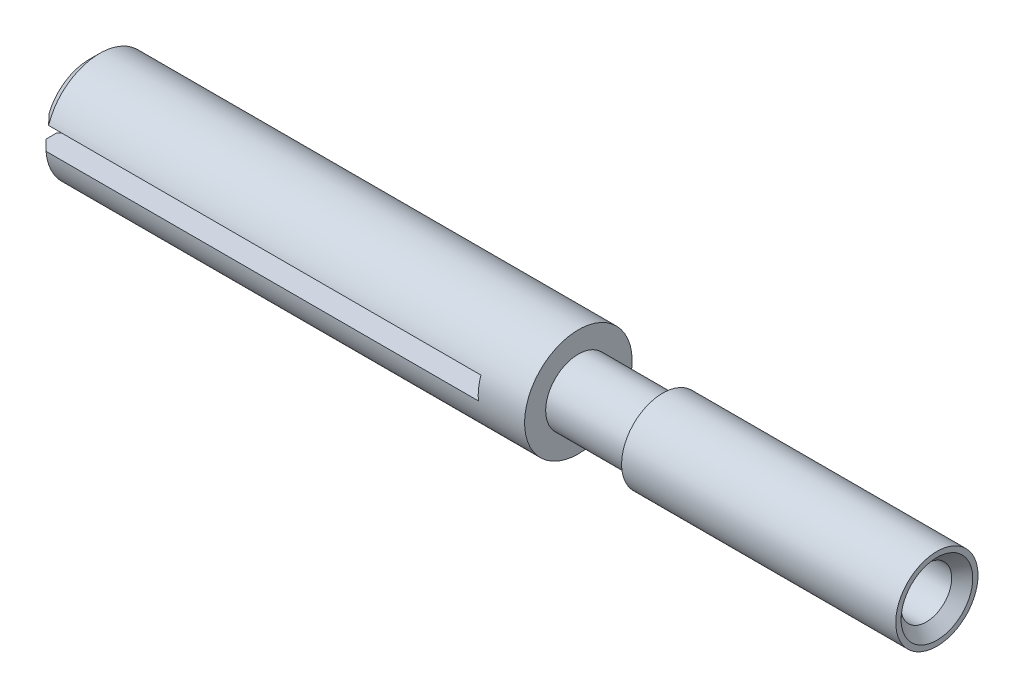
ISO-10303-21;
HEADER;
FILE_DESCRIPTION(('STEP AP214'),'2;1');
FILE_NAME('part.step','',(''),(''),'','','');
FILE_SCHEMA(('AUTOMOTIVE_DESIGN { 1 0 10303 214 1 1 1 1 }'));
ENDSEC;
DATA;
#1=APPLICATION_CONTEXT('core data for automotive mechanical design processes');
#2=APPLICATION_PROTOCOL_DEFINITION('international standard','automotive_design',2000,#1);
#3=PRODUCT_CONTEXT('',#1,'mechanical');
#4=PRODUCT('Part','Part','',(#3));
#5=PRODUCT_RELATED_PRODUCT_CATEGORY('part','',(#4));
#6=PRODUCT_DEFINITION_FORMATION('','',#4);
#7=PRODUCT_DEFINITION_CONTEXT('part definition',#1,'design');
#8=PRODUCT_DEFINITION('design','',#6,#7);
#9=PRODUCT_DEFINITION_SHAPE('','',#8);
#10=(LENGTH_UNIT() NAMED_UNIT(*) SI_UNIT(.MILLI.,.METRE.));
#11=(NAMED_UNIT(*) PLANE_ANGLE_UNIT() SI_UNIT($,.RADIAN.));
#12=(NAMED_UNIT(*) SI_UNIT($,.STERADIAN.) SOLID_ANGLE_UNIT());
#13=UNCERTAINTY_MEASURE_WITH_UNIT(LENGTH_MEASURE(1.E-05),#10,'distance_accuracy_value','');
#14=(GEOMETRIC_REPRESENTATION_CONTEXT(3) GLOBAL_UNCERTAINTY_ASSIGNED_CONTEXT((#13)) GLOBAL_UNIT_ASSIGNED_CONTEXT((#10,
#11,#12)) REPRESENTATION_CONTEXT('',''));
#15=CARTESIAN_POINT('',(0.,0.,0.));
#16=DIRECTION('',(0.,0.,1.));
#17=DIRECTION('',(1.,0.,0.));
#18=AXIS2_PLACEMENT_3D('',#15,#16,#17);
#19=CARTESIAN_POINT('',(-28.7,-0.300000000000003,0.));
#20=DIRECTION('',(-1.,0.,0.));
#21=DIRECTION('',(0.,-1.,0.));
#22=AXIS2_PLACEMENT_3D('',#19,#20,#21);
#23=CONICAL_SURFACE('',#22,1.55,0.785398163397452);
#24=CARTESIAN_POINT('',(-28.7,-0.300000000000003,0.));
#25=DIRECTION('',(-1.,0.,0.));
#26=DIRECTION('',(0.,-1.,0.));
#27=AXIS2_PLACEMENT_3D('',#24,#25,#26);
#28=CIRCLE('',#27,1.55);
#29=CARTESIAN_POINT('',(-28.7,0.499999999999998,1.32759180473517));
#30=VERTEX_POINT('',#29);
#31=CARTESIAN_POINT('',(-28.7,0.499999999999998,-1.32759180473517));
#32=VERTEX_POINT('',#31);
#33=EDGE_CURVE('E232',#30,#32,#28,.T.);
#34=ORIENTED_EDGE('',*,*,#33,.T.);
#35=CARTESIAN_POINT('',(-29.7599731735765,0.499999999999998,-2.48434296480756));
#36=CARTESIAN_POINT('',(-29.7108259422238,0.499999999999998,-2.43270831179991));
#37=CARTESIAN_POINT('',(-29.6617519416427,0.499999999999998,-2.38100379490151));
#38=CARTESIAN_POINT('',(-29.5637859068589,0.499999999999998,-2.27742116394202));
#39=CARTESIAN_POINT('',(-29.5148938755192,0.499999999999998,-2.22554304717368));
#40=CARTESIAN_POINT('',(-29.3684921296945,0.499999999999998,-2.0695421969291));
#41=CARTESIAN_POINT('',(-29.2713114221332,0.499999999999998,-1.965110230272));
#42=CARTESIAN_POINT('',(-29.0783894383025,0.499999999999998,-1.75511516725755));
#43=CARTESIAN_POINT('',(-28.9826467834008,0.499999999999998,-1.64955334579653));
#44=CARTESIAN_POINT('',(-28.8407493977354,0.499999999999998,-1.48970567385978));
#45=CARTESIAN_POINT('',(-28.7937414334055,0.499999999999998,-1.43617825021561));
#46=CARTESIAN_POINT('',(-28.7005012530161,0.499999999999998,-1.3284530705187));
#47=CARTESIAN_POINT('',(-28.6542690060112,0.499999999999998,-1.2742553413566));
#48=CARTESIAN_POINT('',(-28.5749164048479,0.499999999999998,-1.17935241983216));
#49=CARTESIAN_POINT('',(-28.5415498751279,0.499999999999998,-1.13885340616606));
#50=CARTESIAN_POINT('',(-28.4755789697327,0.499999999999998,-1.05723155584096));
#51=CARTESIAN_POINT('',(-28.4429746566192,0.499999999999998,-1.0161086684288));
#52=CARTESIAN_POINT('',(-28.3786844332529,0.499999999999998,-0.93293329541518));
#53=CARTESIAN_POINT('',(-28.3470018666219,0.499999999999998,-0.890878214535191));
#54=CARTESIAN_POINT('',(-28.285056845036,0.499999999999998,-0.805735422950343));
#55=CARTESIAN_POINT('',(-28.2547941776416,0.499999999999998,-0.762647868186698));
#56=CARTESIAN_POINT('',(-28.2016493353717,0.499999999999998,-0.683133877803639));
#57=CARTESIAN_POINT('',(-28.1784309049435,0.499999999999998,-0.6469336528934));
#58=CARTESIAN_POINT('',(-28.1338275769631,0.499999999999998,-0.573387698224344));
#59=CARTESIAN_POINT('',(-28.1124434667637,0.499999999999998,-0.536041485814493));
#60=CARTESIAN_POINT('',(-28.0723192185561,0.499999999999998,-0.460116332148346));
#61=CARTESIAN_POINT('',(-28.053569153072,0.499999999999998,-0.421542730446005));
#62=CARTESIAN_POINT('',(-28.0196567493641,0.499999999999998,-0.342872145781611));
#63=CARTESIAN_POINT('',(-28.0044903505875,0.499999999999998,-0.302776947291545));
#64=CARTESIAN_POINT('',(-27.9769888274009,0.499999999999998,-0.214339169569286));
#65=CARTESIAN_POINT('',(-27.9655132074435,0.499999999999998,-0.165714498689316));
#66=CARTESIAN_POINT('',(-27.9513678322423,0.499999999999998,-0.0673187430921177));
#67=CARTESIAN_POINT('',(-27.9486629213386,0.499999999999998,-0.0175530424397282));
#68=CARTESIAN_POINT('',(-27.9526186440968,0.499999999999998,0.0816050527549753));
#69=CARTESIAN_POINT('',(-27.9592841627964,0.499999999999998,0.130997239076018));
#70=CARTESIAN_POINT('',(-27.9805329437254,0.499999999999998,0.228168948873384));
#71=CARTESIAN_POINT('',(-27.995151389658,0.499999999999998,0.275940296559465));
#72=CARTESIAN_POINT('',(-28.0337889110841,0.499999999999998,0.379289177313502));
#73=CARTESIAN_POINT('',(-28.0591512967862,0.499999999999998,0.434345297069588));
#74=CARTESIAN_POINT('',(-28.1151008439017,0.499999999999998,0.541780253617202));
#75=CARTESIAN_POINT('',(-28.1456996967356,0.499999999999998,0.594152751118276));
#76=CARTESIAN_POINT('',(-28.2106337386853,0.499999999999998,0.697554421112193));
#77=CARTESIAN_POINT('',(-28.2450165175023,0.499999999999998,0.748553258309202));
#78=CARTESIAN_POINT('',(-28.2982179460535,0.499999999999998,0.823841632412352));
#79=CARTESIAN_POINT('',(-28.3162132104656,0.499999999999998,0.848723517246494));
#80=CARTESIAN_POINT('',(-28.352661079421,0.499999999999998,0.898149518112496));
#81=CARTESIAN_POINT('',(-28.3711136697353,0.499999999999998,0.922693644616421));
#82=CARTESIAN_POINT('',(-28.4339066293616,0.499999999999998,1.00489539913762));
#83=CARTESIAN_POINT('',(-28.4791097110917,0.499999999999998,1.06189333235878));
#84=CARTESIAN_POINT('',(-28.5709103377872,0.499999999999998,1.17475824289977));
#85=CARTESIAN_POINT('',(-28.6175080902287,0.499999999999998,1.23062504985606));
#86=CARTESIAN_POINT('',(-28.7116990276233,0.499999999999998,1.34155219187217));
#87=CARTESIAN_POINT('',(-28.7592926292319,0.499999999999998,1.39661217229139));
#88=CARTESIAN_POINT('',(-28.8551906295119,0.499999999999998,1.50611056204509));
#89=CARTESIAN_POINT('',(-28.9034950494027,0.499999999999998,1.56054895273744));
#90=CARTESIAN_POINT('',(-29.0493946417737,0.499999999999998,1.72338308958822));
#91=CARTESIAN_POINT('',(-29.1477798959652,0.499999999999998,1.83107005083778));
#92=CARTESIAN_POINT('',(-29.3457737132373,0.499999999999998,2.0452544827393));
#93=CARTESIAN_POINT('',(-29.4453819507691,0.499999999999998,2.15175225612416));
#94=CARTESIAN_POINT('',(-29.6334507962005,0.499999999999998,2.35127575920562));
#95=CARTESIAN_POINT('',(-29.7218190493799,0.499999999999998,2.44438862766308));
#96=CARTESIAN_POINT('',(-29.899018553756,0.499999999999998,2.63018650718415));
#97=CARTESIAN_POINT('',(-29.9878498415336,0.499999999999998,2.72287148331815));
#98=CARTESIAN_POINT('',(-30.1655275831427,0.499999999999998,2.90758385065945));
#99=CARTESIAN_POINT('',(-30.2543728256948,0.499999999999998,2.99961240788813));
#100=CARTESIAN_POINT('',(-30.4323141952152,0.499999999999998,3.18341040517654));
#101=CARTESIAN_POINT('',(-30.5214102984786,0.499999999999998,3.27517986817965));
#102=CARTESIAN_POINT('',(-30.6105984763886,0.499999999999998,3.36685933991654));
#103=B_SPLINE_CURVE_WITH_KNOTS('',3,(#35,#36,#37,#38,#39,#40,#41,#42,#43,#44,#45,#46,#47,#48,
#49,#50,#51,#52,#53,#54,#55,#56,#57,#58,#59,#60,#61,#62,#63,#64,#65,#66,#67,#68,#69,#70,#71,#72,
#73,#74,#75,#76,#77,#78,#79,#80,#81,#82,#83,#84,#85,#86,#87,#88,#89,#90,#91,#92,#93,#94,#95,#96,
#97,#98,#99,#100,#101,#102),.UNSPECIFIED.,.F.,.F.,(4,2,2,2,2,2,2,2,2,2,2,2,2,2,2,2,2,2,2,2,2,2,
2,2,2,2,2,2,2,2,2,2,2,4),(0.,0.213855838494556,0.427715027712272,0.855670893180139,
1.28318626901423,1.49689705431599,1.71059929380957,1.86801380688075,2.02544119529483,
2.1833822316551,2.34129956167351,2.47027929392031,2.59931411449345,2.72784875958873,
2.85623705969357,3.00547082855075,3.15410567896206,3.30281804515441,3.4521937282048,
3.63358538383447,3.81538744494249,3.99981582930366,4.09193450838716,4.18405032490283,
4.40225224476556,4.620486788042,4.83881454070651,5.05714882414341,5.49471912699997,
5.93217537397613,6.31728429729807,6.70242412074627,7.0861742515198,7.46988926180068),.UNSPECIFIED.);
#104=CARTESIAN_POINT('',(-28.2,0.499999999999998,-0.680073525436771));
#105=VERTEX_POINT('',#104);
#106=EDGE_CURVE('E145',#32,#105,#103,.T.);
#107=ORIENTED_EDGE('',*,*,#106,.T.);
#108=CARTESIAN_POINT('',(-28.2,-0.300000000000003,0.));
#109=DIRECTION('',(-1.,0.,0.));
#110=DIRECTION('',(0.,-1.,0.));
#111=AXIS2_PLACEMENT_3D('',#108,#109,#110);
#112=CIRCLE('',#111,1.05);
#113=CARTESIAN_POINT('',(-28.2,0.499999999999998,0.680073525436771));
#114=VERTEX_POINT('',#113);
#115=EDGE_CURVE('E188',#114,#105,#112,.T.);
#116=ORIENTED_EDGE('',*,*,#115,.F.);
#117=EDGE_CURVE('E150',#114,#30,#103,.T.);
#118=ORIENTED_EDGE('',*,*,#117,.T.);
#119=EDGE_LOOP('',(#34,#107,#116,#118));
#120=FACE_BOUND('',#119,.T.);
#121=ADVANCED_FACE('F30',(#120),#23,.F.);
#122=CARTESIAN_POINT('',(-28.7,1.74999999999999,0.));
#123=DIRECTION('',(1.,0.,0.));
#124=DIRECTION('',(0.,1.,0.));
#125=AXIS2_PLACEMENT_3D('',#122,#123,#124);
#126=PLANE('',#125);
#127=CARTESIAN_POINT('',(-28.7,-0.300000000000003,0.));
#128=DIRECTION('',(-1.,0.,0.));
#129=DIRECTION('',(0.,-1.,0.));
#130=AXIS2_PLACEMENT_3D('',#127,#128,#129);
#131=CIRCLE('',#130,2.05);
#132=CARTESIAN_POINT('',(-28.7,0.499999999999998,1.88745860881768));
#133=VERTEX_POINT('',#132);
#134=CARTESIAN_POINT('',(-28.7,0.499999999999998,-1.88745860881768));
#135=VERTEX_POINT('',#134);
#136=EDGE_CURVE('E228',#133,#135,#131,.T.);
#137=ORIENTED_EDGE('',*,*,#136,.T.);
#138=DIRECTION('',(0.,0.,-1.));
#139=VECTOR('',#138,1.);
#140=CARTESIAN_POINT('',(-28.7,0.499999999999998,-3.));
#141=LINE('',#140,#139);
#142=EDGE_CURVE('E254',#32,#135,#141,.T.);
#143=ORIENTED_EDGE('',*,*,#142,.F.);
#144=ORIENTED_EDGE('',*,*,#33,.F.);
#145=EDGE_CURVE('E260',#133,#30,#141,.T.);
#146=ORIENTED_EDGE('',*,*,#145,.F.);
#147=EDGE_LOOP('',(#137,#143,#144,#146));
#148=FACE_BOUND('',#147,.T.);
#149=ADVANCED_FACE('F257',(#148),#126,.F.);
#150=CARTESIAN_POINT('',(-28.2,-0.300000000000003,0.));
#151=DIRECTION('',(1.,0.,0.));
#152=DIRECTION('',(0.,1.,0.));
#153=AXIS2_PLACEMENT_3D('',#150,#151,#152);
#154=CONICAL_SURFACE('',#153,2.54999999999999,0.785398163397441);
#155=CARTESIAN_POINT('',(-28.2,-0.300000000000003,0.));
#156=DIRECTION('',(-1.,0.,0.));
#157=DIRECTION('',(0.,-1.,0.));
#158=AXIS2_PLACEMENT_3D('',#155,#156,#157);
#159=CIRCLE('',#158,2.54999999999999);
#160=CARTESIAN_POINT('',(-28.2,0.499999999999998,2.42126000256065));
#161=VERTEX_POINT('',#160);
#162=CARTESIAN_POINT('',(-28.2,0.499999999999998,-2.42126000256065));
#163=VERTEX_POINT('',#162);
#164=EDGE_CURVE('E143',#161,#163,#159,.T.);
#165=ORIENTED_EDGE('',*,*,#164,.T.);
#166=CARTESIAN_POINT('',(-26.5089982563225,0.499999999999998,-4.16486443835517));
#167=CARTESIAN_POINT('',(-26.6684103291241,0.499999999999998,-4.00250170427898));
#168=CARTESIAN_POINT('',(-26.8276882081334,0.499999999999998,-3.84000561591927));
#169=CARTESIAN_POINT('',(-27.145747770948,0.499999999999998,-3.51452808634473));
#170=CARTESIAN_POINT('',(-27.304529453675,0.499999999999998,-3.35154664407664));
#171=CARTESIAN_POINT('',(-27.622314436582,0.499999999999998,-3.02390479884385));
#172=CARTESIAN_POINT('',(-27.7813133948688,0.499999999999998,-2.85924018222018));
#173=CARTESIAN_POINT('',(-28.0981332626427,0.499999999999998,-2.52876685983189));
#174=CARTESIAN_POINT('',(-28.2559541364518,0.499999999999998,-2.36295811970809));
#175=CARTESIAN_POINT('',(-28.4783601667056,0.499999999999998,-2.12624135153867));
#176=CARTESIAN_POINT('',(-28.5438366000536,0.499999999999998,-2.0561714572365));
#177=CARTESIAN_POINT('',(-28.6742647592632,0.499999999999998,-1.91556065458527));
#178=CARTESIAN_POINT('',(-28.7392165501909,0.499999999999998,-1.84501980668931));
#179=CARTESIAN_POINT('',(-28.8682571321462,0.499999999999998,-1.70346735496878));
#180=CARTESIAN_POINT('',(-28.9323476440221,0.499999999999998,-1.63245732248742));
#181=CARTESIAN_POINT('',(-29.0595585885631,0.499999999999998,-1.48951671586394));
#182=CARTESIAN_POINT('',(-29.1226786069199,0.499999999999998,-1.417585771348));
#183=CARTESIAN_POINT('',(-29.2477393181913,0.499999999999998,-1.27207666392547));
#184=CARTESIAN_POINT('',(-29.3096725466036,0.499999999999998,-1.19849206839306));
#185=CARTESIAN_POINT('',(-29.431112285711,0.499999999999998,-1.04945550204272));
#186=CARTESIAN_POINT('',(-29.490621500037,0.499999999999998,-0.974005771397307));
#187=CARTESIAN_POINT('',(-29.5769538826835,0.499999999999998,-0.858305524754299));
#188=CARTESIAN_POINT('',(-29.6053155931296,0.499999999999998,-0.819208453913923));
#189=CARTESIAN_POINT('',(-29.6605829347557,0.499999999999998,-0.740025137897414));
#190=CARTESIAN_POINT('',(-29.6874893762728,0.499999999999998,-0.699939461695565));
#191=CARTESIAN_POINT('',(-29.7394035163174,0.499999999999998,-0.618306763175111));
#192=CARTESIAN_POINT('',(-29.7644030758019,0.499999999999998,-0.576754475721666));
#193=CARTESIAN_POINT('',(-29.799724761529,0.499999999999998,-0.513159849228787));
#194=CARTESIAN_POINT('',(-29.8111456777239,0.499999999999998,-0.491729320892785));
#195=CARTESIAN_POINT('',(-29.8330936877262,0.499999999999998,-0.44840233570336));
#196=CARTESIAN_POINT('',(-29.8436203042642,0.499999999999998,-0.426505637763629));
#197=CARTESIAN_POINT('',(-29.8536148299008,0.499999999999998,-0.404359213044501));
#198=B_SPLINE_CURVE_WITH_KNOTS('',3,(#166,#167,#168,#169,#170,#171,#172,#173,#174,#175,#176,
#177,#178,#179,#180,#181,#182,#183,#184,#185,#186,#187,#188,#189,#190,#191,#192,#193,#194,#195,
#196,#197),.UNSPECIFIED.,.F.,.F.,(4,2,2,2,2,2,2,2,2,2,2,2,2,2,2,4),(0.,0.682617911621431,
1.36523730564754,2.05193431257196,2.73865203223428,3.02635245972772,3.31401664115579,
3.60097795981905,3.88805856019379,4.1765729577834,4.46475621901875,4.60963501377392,
4.75443228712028,4.89981652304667,4.97264929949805,5.04552070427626),.UNSPECIFIED.);
#199=EDGE_CURVE('E179',#163,#135,#198,.T.);
#200=ORIENTED_EDGE('',*,*,#199,.T.);
#201=ORIENTED_EDGE('',*,*,#136,.F.);
#202=CARTESIAN_POINT('',(-29.325163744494,0.499999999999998,1.17904976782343));
#203=CARTESIAN_POINT('',(-29.2777079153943,0.499999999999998,1.23635550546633));
#204=CARTESIAN_POINT('',(-29.2296540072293,0.499999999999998,1.29315700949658));
#205=CARTESIAN_POINT('',(-29.1326314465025,0.499999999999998,1.40596369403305));
#206=CARTESIAN_POINT('',(-29.083662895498,0.499999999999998,1.46196896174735));
#207=CARTESIAN_POINT('',(-28.9358143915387,0.499999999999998,1.62910127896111));
#208=CARTESIAN_POINT('',(-28.8359691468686,0.499999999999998,1.73937142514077));
#209=CARTESIAN_POINT('',(-28.6024032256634,0.499999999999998,1.99385936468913));
#210=CARTESIAN_POINT('',(-28.4681320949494,0.499999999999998,2.13756886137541));
#211=CARTESIAN_POINT('',(-28.1981645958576,0.499999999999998,2.42364673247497));
#212=CARTESIAN_POINT('',(-28.0624681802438,0.499999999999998,2.56601506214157));
#213=CARTESIAN_POINT('',(-27.7901163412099,0.499999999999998,2.85000761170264));
#214=CARTESIAN_POINT('',(-27.6534603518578,0.499999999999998,2.99163128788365));
#215=CARTESIAN_POINT('',(-27.379566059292,0.499999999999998,3.27428823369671));
#216=CARTESIAN_POINT('',(-27.2423278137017,0.499999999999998,3.41532155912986));
#217=CARTESIAN_POINT('',(-27.1049298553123,0.499999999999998,3.55619689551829));
#218=B_SPLINE_CURVE_WITH_KNOTS('',3,(#202,#203,#204,#205,#206,#207,#208,#209,#210,#211,#212,
#213,#214,#215,#216,#217),.UNSPECIFIED.,.F.,.F.,(4,2,2,2,2,2,2,4),(0.,0.223198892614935,
0.446373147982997,0.892617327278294,1.48262660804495,2.07265550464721,2.66306785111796,
3.25342307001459),.UNSPECIFIED.);
#219=EDGE_CURVE('E144',#133,#161,#218,.T.);
#220=ORIENTED_EDGE('',*,*,#219,.T.);
#221=EDGE_LOOP('',(#165,#200,#201,#220));
#222=FACE_BOUND('',#221,.T.);
#223=ADVANCED_FACE('F306',(#222),#154,.T.);
#224=CARTESIAN_POINT('',(-28.2,-0.500000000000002,-1.03077640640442));
#225=VERTEX_POINT('',#224);
#226=CARTESIAN_POINT('',(-28.2,-0.500000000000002,1.03077640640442));
#227=VERTEX_POINT('',#226);
#228=EDGE_CURVE('E185',#225,#227,#112,.T.);
#229=ORIENTED_EDGE('',*,*,#228,.F.);
#230=CARTESIAN_POINT('',(-27.4169346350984,-0.500000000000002,-0.176788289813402));
#231=CARTESIAN_POINT('',(-27.4241939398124,-0.500000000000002,-0.18773242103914));
#232=CARTESIAN_POINT('',(-27.4316965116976,-0.500000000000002,-0.198508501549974));
#233=CARTESIAN_POINT('',(-27.4470706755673,-0.500000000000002,-0.219787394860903));
#234=CARTESIAN_POINT('',(-27.4549420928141,-0.500000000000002,-0.230290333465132));
#235=CARTESIAN_POINT('',(-27.4789256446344,-0.500000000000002,-0.261474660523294));
#236=CARTESIAN_POINT('',(-27.4954243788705,-0.500000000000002,-0.281856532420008));
#237=CARTESIAN_POINT('',(-27.5289827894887,-0.500000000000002,-0.322101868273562));
#238=CARTESIAN_POINT('',(-27.5460417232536,-0.500000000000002,-0.341965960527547));
#239=CARTESIAN_POINT('',(-27.5805341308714,-0.500000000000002,-0.381378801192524));
#240=CARTESIAN_POINT('',(-27.5979677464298,-0.500000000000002,-0.400927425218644));
#241=CARTESIAN_POINT('',(-27.6504534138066,-0.500000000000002,-0.459058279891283));
#242=CARTESIAN_POINT('',(-27.6858581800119,-0.500000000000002,-0.497320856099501));
#243=CARTESIAN_POINT('',(-27.7571416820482,-0.500000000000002,-0.573402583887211));
#244=CARTESIAN_POINT('',(-27.7930204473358,-0.500000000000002,-0.611221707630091));
#245=CARTESIAN_POINT('',(-27.901056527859,-0.500000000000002,-0.724288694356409));
#246=CARTESIAN_POINT('',(-27.9736175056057,-0.500000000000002,-0.799150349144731));
#247=CARTESIAN_POINT('',(-28.11932645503,-0.500000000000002,-0.948604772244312));
#248=CARTESIAN_POINT('',(-28.1924753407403,-0.500000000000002,-1.02319664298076));
#249=CARTESIAN_POINT('',(-28.3390086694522,-0.500000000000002,-1.17214407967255));
#250=CARTESIAN_POINT('',(-28.4123931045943,-0.500000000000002,-1.24649965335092));
#251=CARTESIAN_POINT('',(-28.5776791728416,-0.500000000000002,-1.41366874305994));
#252=CARTESIAN_POINT('',(-28.6696188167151,-0.500000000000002,-1.50644461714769));
#253=CARTESIAN_POINT('',(-28.8536197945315,-0.500000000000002,-1.69187793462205));
#254=CARTESIAN_POINT('',(-28.9456811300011,-0.500000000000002,-1.78453537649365));
#255=CARTESIAN_POINT('',(-29.129603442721,-0.500000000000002,-1.96949893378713));
#256=CARTESIAN_POINT('',(-29.2214641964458,-0.500000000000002,-2.06180527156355));
#257=CARTESIAN_POINT('',(-29.4052359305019,-0.500000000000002,-2.24636533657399));
#258=CARTESIAN_POINT('',(-29.4971469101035,-0.500000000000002,-2.33861906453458));
#259=CARTESIAN_POINT('',(-29.5890721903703,-0.500000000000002,-2.430858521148));
#260=B_SPLINE_CURVE_WITH_KNOTS('',3,(#230,#231,#232,#233,#234,#235,#236,#237,#238,#239,#240,
#241,#242,#243,#244,#245,#246,#247,#248,#249,#250,#251,#252,#253,#254,#255,#256,#257,#258,#259),
.UNSPECIFIED.,.F.,.F.,(4,2,2,2,2,2,2,2,2,2,2,2,2,2,4),(0.,0.0393871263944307,0.0787557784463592,
0.157402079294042,0.235948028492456,0.314524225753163,0.470904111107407,0.627293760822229,
0.940055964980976,1.25347645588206,1.56688659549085,1.95873129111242,2.35058095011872,
2.74125947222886,3.13193246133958),.UNSPECIFIED.);
#261=CARTESIAN_POINT('',(-28.7,-0.500000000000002,-1.53704261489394));
#262=VERTEX_POINT('',#261);
#263=EDGE_CURVE('E267',#225,#262,#260,.T.);
#264=ORIENTED_EDGE('',*,*,#263,.T.);
#265=CARTESIAN_POINT('',(-28.7,-0.500000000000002,1.53704261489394));
#266=VERTEX_POINT('',#265);
#267=EDGE_CURVE('E229',#262,#266,#28,.T.);
#268=ORIENTED_EDGE('',*,*,#267,.T.);
#269=CARTESIAN_POINT('',(-29.2332704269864,-0.500000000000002,2.07364791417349));
#270=CARTESIAN_POINT('',(-29.1546203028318,-0.500000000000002,1.99462844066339));
#271=CARTESIAN_POINT('',(-29.0759868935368,-0.500000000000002,1.91559228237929));
#272=CARTESIAN_POINT('',(-28.9187941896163,-0.500000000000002,1.75747282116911));
#273=CARTESIAN_POINT('',(-28.8402348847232,-0.500000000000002,1.67838952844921));
#274=CARTESIAN_POINT('',(-28.6832408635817,-0.500000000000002,1.5201720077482));
#275=CARTESIAN_POINT('',(-28.6048061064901,-0.500000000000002,1.4410378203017));
#276=CARTESIAN_POINT('',(-28.4480644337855,-0.500000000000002,1.28261711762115));
#277=CARTESIAN_POINT('',(-28.3697575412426,-0.500000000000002,1.20333057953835));
#278=CARTESIAN_POINT('',(-28.2524479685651,-0.500000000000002,1.0841765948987));
#279=CARTESIAN_POINT('',(-28.2133510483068,-0.500000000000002,1.04440196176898));
#280=CARTESIAN_POINT('',(-28.1352490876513,-0.500000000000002,0.964767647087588));
#281=CARTESIAN_POINT('',(-28.0962440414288,-0.500000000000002,0.924907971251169));
#282=CARTESIAN_POINT('',(-28.0183821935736,-0.500000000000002,0.84508309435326));
#283=CARTESIAN_POINT('',(-27.9795253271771,-0.500000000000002,0.805117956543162));
#284=CARTESIAN_POINT('',(-27.9019999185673,-0.500000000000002,0.724987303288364));
#285=CARTESIAN_POINT('',(-27.8633314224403,-0.500000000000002,0.684821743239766));
#286=CARTESIAN_POINT('',(-27.7862460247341,-0.500000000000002,0.604115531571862));
#287=CARTESIAN_POINT('',(-27.7478296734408,-0.500000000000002,0.5635743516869));
#288=CARTESIAN_POINT('',(-27.6906641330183,-0.500000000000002,0.502363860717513));
#289=CARTESIAN_POINT('',(-27.6716929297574,-0.500000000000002,0.481902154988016));
#290=CARTESIAN_POINT('',(-27.633959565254,-0.500000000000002,0.440777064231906));
#291=CARTESIAN_POINT('',(-27.6151974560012,-0.500000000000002,0.420113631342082));
#292=CARTESIAN_POINT('',(-27.577940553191,-0.500000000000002,0.378444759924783));
#293=CARTESIAN_POINT('',(-27.5594466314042,-0.500000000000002,0.357438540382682));
#294=CARTESIAN_POINT('',(-27.5229723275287,-0.500000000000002,0.315004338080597));
#295=CARTESIAN_POINT('',(-27.5049916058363,-0.500000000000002,0.293576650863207));
#296=CARTESIAN_POINT('',(-27.4786503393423,-0.500000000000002,0.260868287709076));
#297=CARTESIAN_POINT('',(-27.4699615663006,-0.500000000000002,0.249853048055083));
#298=CARTESIAN_POINT('',(-27.452895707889,-0.500000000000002,0.227589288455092));
#299=CARTESIAN_POINT('',(-27.4445185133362,-0.500000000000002,0.21634085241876));
#300=CARTESIAN_POINT('',(-27.4281715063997,-0.500000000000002,0.193505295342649));
#301=CARTESIAN_POINT('',(-27.4202027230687,-0.500000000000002,0.181917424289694));
#302=CARTESIAN_POINT('',(-27.4049158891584,-0.500000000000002,0.158302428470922));
#303=CARTESIAN_POINT('',(-27.3975986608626,-0.500000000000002,0.146274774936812));
#304=CARTESIAN_POINT('',(-27.3907283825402,-0.500000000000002,0.133978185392));
#305=B_SPLINE_CURVE_WITH_KNOTS('',3,(#269,#270,#271,#272,#273,#274,#275,#276,#277,#278,#279,
#280,#281,#282,#283,#284,#285,#286,#287,#288,#289,#290,#291,#292,#293,#294,#295,#296,#297,#298,
#299,#300,#301,#302,#303,#304),.UNSPECIFIED.,.F.,.F.,(4,2,2,2,2,2,2,2,2,2,2,2,2,2,2,2,2,4),(0.,
0.334468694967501,0.668880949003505,1.00313837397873,1.3374506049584,1.50476851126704,
1.67207550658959,1.83929824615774,2.00656002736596,2.17411086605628,2.25781950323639,
2.34154850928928,2.42550658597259,2.50940775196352,2.55149246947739,2.59356229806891,
2.63573338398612,2.67795695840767),.UNSPECIFIED.);
#306=EDGE_CURVE('E273',#266,#227,#305,.T.);
#307=ORIENTED_EDGE('',*,*,#306,.T.);
#308=EDGE_LOOP('',(#229,#264,#268,#307));
#309=FACE_BOUND('',#308,.T.);
#310=ADVANCED_FACE('F32',(#309),#23,.F.);
#311=CARTESIAN_POINT('',(-28.7,-0.500000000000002,-2.04022057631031));
#312=VERTEX_POINT('',#311);
#313=CARTESIAN_POINT('',(-28.7,-0.500000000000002,2.04022057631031));
#314=VERTEX_POINT('',#313);
#315=EDGE_CURVE('E225',#312,#314,#131,.T.);
#316=ORIENTED_EDGE('',*,*,#315,.T.);
#317=DIRECTION('',(0.,0.,1.));
#318=VECTOR('',#317,1.);
#319=CARTESIAN_POINT('',(-28.7,-0.500000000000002,-3.));
#320=LINE('',#319,#318);
#321=EDGE_CURVE('E263',#266,#314,#320,.T.);
#322=ORIENTED_EDGE('',*,*,#321,.F.);
#323=ORIENTED_EDGE('',*,*,#267,.F.);
#324=EDGE_CURVE('E261',#312,#262,#320,.T.);
#325=ORIENTED_EDGE('',*,*,#324,.F.);
#326=EDGE_LOOP('',(#316,#322,#323,#325));
#327=FACE_BOUND('',#326,.T.);
#328=ADVANCED_FACE('F301',(#327),#126,.F.);
#329=ORIENTED_EDGE('',*,*,#315,.F.);
#330=CARTESIAN_POINT('',(-30.3389408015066,-0.500000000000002,-0.359123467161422));
#331=CARTESIAN_POINT('',(-30.3124776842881,-0.500000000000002,-0.389339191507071));
#332=CARTESIAN_POINT('',(-30.2856505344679,-0.500000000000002,-0.41922804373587));
#333=CARTESIAN_POINT('',(-30.2314980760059,-0.500000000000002,-0.478545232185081));
#334=CARTESIAN_POINT('',(-30.2041728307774,-0.500000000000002,-0.507973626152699));
#335=CARTESIAN_POINT('',(-30.1492515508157,-0.500000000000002,-0.566566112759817));
#336=CARTESIAN_POINT('',(-30.1216555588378,-0.500000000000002,-0.595730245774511));
#337=CARTESIAN_POINT('',(-30.0662745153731,-0.500000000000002,-0.653880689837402));
#338=CARTESIAN_POINT('',(-30.0384894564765,-0.500000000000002,-0.682866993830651));
#339=CARTESIAN_POINT('',(-29.9549754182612,-0.500000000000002,-0.76961764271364));
#340=CARTESIAN_POINT('',(-29.8990603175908,-0.500000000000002,-0.827202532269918));
#341=CARTESIAN_POINT('',(-29.7869683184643,-0.500000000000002,-0.942117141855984));
#342=CARTESIAN_POINT('',(-29.7307914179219,-0.500000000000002,-0.999446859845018));
#343=CARTESIAN_POINT('',(-29.5620319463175,-0.500000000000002,-1.17121062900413));
#344=CARTESIAN_POINT('',(-29.4492203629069,-0.500000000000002,-1.28541954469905));
#345=CARTESIAN_POINT('',(-29.2233232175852,-0.500000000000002,-1.51359989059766));
#346=CARTESIAN_POINT('',(-29.110237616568,-0.500000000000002,-1.62757128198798));
#347=CARTESIAN_POINT('',(-28.8839248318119,-0.500000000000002,-1.85537243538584));
#348=CARTESIAN_POINT('',(-28.7706976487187,-0.500000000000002,-1.96920219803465));
#349=CARTESIAN_POINT('',(-28.6278661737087,-0.500000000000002,-2.11269015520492));
#350=CARTESIAN_POINT('',(-28.5983001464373,-0.500000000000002,-2.14238647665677));
#351=CARTESIAN_POINT('',(-28.5391637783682,-0.500000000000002,-2.20177293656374));
#352=CARTESIAN_POINT('',(-28.5095934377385,-0.500000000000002,-2.23146307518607));
#353=CARTESIAN_POINT('',(-28.1672457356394,-0.500000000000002,-2.57514981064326));
#354=CARTESIAN_POINT('',(-27.8542389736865,-0.500000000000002,-2.88891786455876));
#355=CARTESIAN_POINT('',(-27.3845798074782,-0.500000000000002,-3.35948358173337));
#356=CARTESIAN_POINT('',(-27.227986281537,-0.500000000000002,-3.5163400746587));
#357=CARTESIAN_POINT('',(-26.9147690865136,-0.500000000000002,-3.83002287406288));
#358=CARTESIAN_POINT('',(-26.7581454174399,-0.500000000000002,-3.98684918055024));
#359=CARTESIAN_POINT('',(-26.6015111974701,-0.500000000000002,-4.14366496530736));
#360=B_SPLINE_CURVE_WITH_KNOTS('',3,(#330,#331,#332,#333,#334,#335,#336,#337,#338,#339,#340,
#341,#342,#343,#344,#345,#346,#347,#348,#349,#350,#351,#352,#353,#354,#355,#356,#357,#358,#359),
.UNSPECIFIED.,.F.,.F.,(4,2,2,2,2,2,2,2,2,2,2,2,2,2,4),(0.,0.120485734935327,0.240956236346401,
0.361408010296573,0.481864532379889,0.722658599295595,0.963454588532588,1.44504552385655,
1.92670979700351,2.40837188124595,2.53408661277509,2.65979732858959,3.98938819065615,
4.6543163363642,5.31924429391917),.UNSPECIFIED.);
#361=CARTESIAN_POINT('',(-28.2,-0.500000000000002,-2.54214476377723));
#362=VERTEX_POINT('',#361);
#363=EDGE_CURVE('E282',#312,#362,#360,.T.);
#364=ORIENTED_EDGE('',*,*,#363,.T.);
#365=CARTESIAN_POINT('',(-28.2,-0.500000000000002,2.54214476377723));
#366=VERTEX_POINT('',#365);
#367=EDGE_CURVE('E222',#362,#366,#159,.T.);
#368=ORIENTED_EDGE('',*,*,#367,.T.);
#369=CARTESIAN_POINT('',(-26.6015111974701,-0.500000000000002,4.14366496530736));
#370=CARTESIAN_POINT('',(-26.7581312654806,-0.500000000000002,3.98686041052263));
#371=CARTESIAN_POINT('',(-26.9147429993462,-0.500000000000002,3.83004752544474));
#372=CARTESIAN_POINT('',(-27.227934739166,-0.500000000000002,3.51639316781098));
#373=CARTESIAN_POINT('',(-27.3845147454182,-0.500000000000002,3.35955169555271));
#374=CARTESIAN_POINT('',(-27.6976267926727,-0.500000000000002,3.04582942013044));
#375=CARTESIAN_POINT('',(-27.8541588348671,-0.500000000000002,2.88894861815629));
#376=CARTESIAN_POINT('',(-28.1671548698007,-0.500000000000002,2.57511612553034));
#377=CARTESIAN_POINT('',(-28.3236188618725,-0.500000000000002,2.41816443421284));
#378=CARTESIAN_POINT('',(-28.5582265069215,-0.500000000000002,2.1826400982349));
#379=CARTESIAN_POINT('',(-28.6364165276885,-0.500000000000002,2.10411364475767));
#380=CARTESIAN_POINT('',(-28.792752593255,-0.500000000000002,1.94701756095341));
#381=CARTESIAN_POINT('',(-28.8708986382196,-0.500000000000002,1.86844793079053));
#382=CARTESIAN_POINT('',(-29.0271257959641,-0.500000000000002,1.71124870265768));
#383=CARTESIAN_POINT('',(-29.105206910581,-0.500000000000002,1.63261910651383));
#384=CARTESIAN_POINT('',(-29.2612746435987,-0.500000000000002,1.47526407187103));
#385=CARTESIAN_POINT('',(-29.3392612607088,-0.500000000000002,1.39653863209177));
#386=CARTESIAN_POINT('',(-29.4950893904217,-0.500000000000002,1.23892839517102));
#387=CARTESIAN_POINT('',(-29.5729308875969,-0.500000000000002,1.16004358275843));
#388=CARTESIAN_POINT('',(-29.689482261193,-0.500000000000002,1.04151250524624));
#389=CARTESIAN_POINT('',(-29.7282966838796,-0.500000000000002,1.00196908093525));
#390=CARTESIAN_POINT('',(-29.8058260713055,-0.500000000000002,0.922783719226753));
#391=CARTESIAN_POINT('',(-29.844541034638,-0.500000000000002,0.883141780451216));
#392=CARTESIAN_POINT('',(-29.9218309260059,-0.500000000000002,0.803709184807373));
#393=CARTESIAN_POINT('',(-29.9604058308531,-0.500000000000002,0.763918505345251));
#394=CARTESIAN_POINT('',(-30.0373256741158,-0.500000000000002,0.68411831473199));
#395=CARTESIAN_POINT('',(-30.07567062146,-0.500000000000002,0.644108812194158));
#396=CARTESIAN_POINT('',(-30.1519878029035,-0.500000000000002,0.5637210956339));
#397=CARTESIAN_POINT('',(-30.1899599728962,-0.500000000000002,0.52334282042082));
#398=CARTESIAN_POINT('',(-30.2463795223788,-0.500000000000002,0.462270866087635));
#399=CARTESIAN_POINT('',(-30.2650974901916,-0.500000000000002,0.441828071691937));
#400=CARTESIAN_POINT('',(-30.3022540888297,-0.500000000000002,0.400687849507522));
#401=CARTESIAN_POINT('',(-30.3206926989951,-0.500000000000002,0.37999040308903));
#402=CARTESIAN_POINT('',(-30.3389408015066,-0.500000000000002,0.359123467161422));
#403=B_SPLINE_CURVE_WITH_KNOTS('',3,(#369,#370,#371,#372,#373,#374,#375,#376,#377,#378,#379,
#380,#381,#382,#383,#384,#385,#386,#387,#388,#389,#390,#391,#392,#393,#394,#395,#396,#397,#398,
#399,#400,#401,#402),.UNSPECIFIED.,.F.,.F.,(4,2,2,2,2,2,2,2,2,2,2,2,2,2,2,2,4),(0.,
0.664874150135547,1.32974173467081,1.99459117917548,2.65944700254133,2.99189360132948,
3.32433894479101,3.65677453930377,3.98921462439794,4.3216882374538,4.48791740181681,
4.65414890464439,4.82040677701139,4.98665815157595,5.15293763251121,5.23608851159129,
5.31924551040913),.UNSPECIFIED.);
#404=EDGE_CURVE('E289',#366,#314,#403,.T.);
#405=ORIENTED_EDGE('',*,*,#404,.T.);
#406=EDGE_LOOP('',(#329,#364,#368,#405));
#407=FACE_BOUND('',#406,.T.);
#408=ADVANCED_FACE('F163',(#407),#154,.T.);
#409=CARTESIAN_POINT('',(-57.7,-0.300000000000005,0.));
#410=DIRECTION('',(-1.,0.,0.));
#411=DIRECTION('',(0.,-1.,0.));
#412=AXIS2_PLACEMENT_3D('',#409,#410,#411);
#413=CYLINDRICAL_SURFACE('',#412,2.55);
#414=CARTESIAN_POINT('',(-7.7,-0.300000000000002,0.));
#415=DIRECTION('',(-1.,0.,0.));
#416=DIRECTION('',(0.,0.,1.));
#417=AXIS2_PLACEMENT_3D('',#414,#415,#416);
#418=CIRCLE('',#417,2.55);
#419=CARTESIAN_POINT('',(-7.7,0.5,-2.42126000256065));
#420=VERTEX_POINT('',#419);
#421=CARTESIAN_POINT('',(-7.7,-0.5,-2.54214476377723));
#422=VERTEX_POINT('',#421);
#423=EDGE_CURVE('E126',#420,#422,#418,.T.);
#424=ORIENTED_EDGE('',*,*,#423,.F.);
#425=DIRECTION('',(-1.,0.,0.));
#426=VECTOR('',#425,1.);
#427=CARTESIAN_POINT('',(-57.7,0.499999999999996,-2.42126000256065));
#428=LINE('',#427,#426);
#429=EDGE_CURVE('E147',#420,#163,#428,.T.);
#430=ORIENTED_EDGE('',*,*,#429,.T.);
#431=ORIENTED_EDGE('',*,*,#164,.F.);
#432=DIRECTION('',(-1.,0.,0.));
#433=VECTOR('',#432,1.);
#434=CARTESIAN_POINT('',(-57.7,0.499999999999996,2.42126000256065));
#435=LINE('',#434,#433);
#436=CARTESIAN_POINT('',(-7.7,0.5,2.42126000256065));
#437=VERTEX_POINT('',#436);
#438=EDGE_CURVE('E130',#161,#437,#435,.F.);
#439=ORIENTED_EDGE('',*,*,#438,.T.);
#440=CARTESIAN_POINT('',(-7.7,-0.5,2.54214476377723));
#441=VERTEX_POINT('',#440);
#442=EDGE_CURVE('E119',#441,#437,#418,.T.);
#443=ORIENTED_EDGE('',*,*,#442,.F.);
#444=DIRECTION('',(-1.,0.,0.));
#445=VECTOR('',#444,1.);
#446=CARTESIAN_POINT('',(-57.7,-0.500000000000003,2.54214476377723));
#447=LINE('',#446,#445);
#448=EDGE_CURVE('E288',#441,#366,#447,.T.);
#449=ORIENTED_EDGE('',*,*,#448,.T.);
#450=ORIENTED_EDGE('',*,*,#367,.F.);
#451=DIRECTION('',(-1.,0.,0.));
#452=VECTOR('',#451,1.);
#453=CARTESIAN_POINT('',(-57.7,-0.500000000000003,-2.54214476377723));
#454=LINE('',#453,#452);
#455=EDGE_CURVE('E279',#362,#422,#454,.F.);
#456=ORIENTED_EDGE('',*,*,#455,.T.);
#457=EDGE_LOOP('',(#424,#430,#431,#439,#443,#449,#450,#456));
#458=FACE_BOUND('',#457,.T.);
#459=CARTESIAN_POINT('',(-5.5,-0.300000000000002,0.));
#460=DIRECTION('',(-1.,0.,0.));
#461=DIRECTION('',(0.,-1.,0.));
#462=AXIS2_PLACEMENT_3D('',#459,#460,#461);
#463=CIRCLE('',#462,2.55);
#464=CARTESIAN_POINT('',(-5.5,-2.85,0.));
#465=VERTEX_POINT('',#464);
#466=EDGE_CURVE('E219',#465,#465,#463,.T.);
#467=ORIENTED_EDGE('',*,*,#466,.T.);
#468=EDGE_LOOP('',(#467));
#469=FACE_BOUND('',#468,.T.);
#470=ADVANCED_FACE('F139',(#458,#469),#413,.T.);
#471=CARTESIAN_POINT('',(-5.5,2.25,0.));
#472=DIRECTION('',(-1.,0.,0.));
#473=DIRECTION('',(0.,-1.,0.));
#474=AXIS2_PLACEMENT_3D('',#471,#472,#473);
#475=PLANE('',#474);
#476=ORIENTED_EDGE('',*,*,#466,.F.);
#477=EDGE_LOOP('',(#476));
#478=FACE_BOUND('',#477,.T.);
#479=CARTESIAN_POINT('',(-5.5,-0.300000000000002,0.));
#480=DIRECTION('',(-1.,0.,0.));
#481=DIRECTION('',(0.,-1.,0.));
#482=AXIS2_PLACEMENT_3D('',#479,#480,#481);
#483=CIRCLE('',#482,1.55);
#484=CARTESIAN_POINT('',(-5.5,-1.85,0.));
#485=VERTEX_POINT('',#484);
#486=EDGE_CURVE('E216',#485,#485,#483,.T.);
#487=ORIENTED_EDGE('',*,*,#486,.T.);
#488=EDGE_LOOP('',(#487));
#489=FACE_BOUND('',#488,.T.);
#490=ADVANCED_FACE('F357',(#478,#489),#475,.F.);
#491=CARTESIAN_POINT('',(-57.7,-0.300000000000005,0.));
#492=DIRECTION('',(-1.,0.,0.));
#493=DIRECTION('',(0.,-1.,0.));
#494=AXIS2_PLACEMENT_3D('',#491,#492,#493);
#495=CYLINDRICAL_SURFACE('',#494,1.55);
#496=ORIENTED_EDGE('',*,*,#486,.F.);
#497=EDGE_LOOP('',(#496));
#498=FACE_BOUND('',#497,.T.);
#499=CARTESIAN_POINT('',(-1.5,-0.300000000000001,0.));
#500=DIRECTION('',(-1.,0.,0.));
#501=DIRECTION('',(0.,-1.,0.));
#502=AXIS2_PLACEMENT_3D('',#499,#500,#501);
#503=CIRCLE('',#502,1.55);
#504=CARTESIAN_POINT('',(-1.5,-1.85,0.));
#505=VERTEX_POINT('',#504);
#506=EDGE_CURVE('E213',#505,#505,#503,.T.);
#507=ORIENTED_EDGE('',*,*,#506,.T.);
#508=EDGE_LOOP('',(#507));
#509=FACE_BOUND('',#508,.T.);
#510=ADVANCED_FACE('F365',(#498,#509),#495,.T.);
#511=CARTESIAN_POINT('',(-1.5,1.25,0.));
#512=DIRECTION('',(1.,0.,0.));
#513=DIRECTION('',(0.,1.,0.));
#514=AXIS2_PLACEMENT_3D('',#511,#512,#513);
#515=PLANE('',#514);
#516=ORIENTED_EDGE('',*,*,#506,.F.);
#517=EDGE_LOOP('',(#516));
#518=FACE_BOUND('',#517,.T.);
#519=CARTESIAN_POINT('',(-1.5,-0.300000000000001,0.));
#520=DIRECTION('',(-1.,0.,0.));
#521=DIRECTION('',(0.,-1.,0.));
#522=AXIS2_PLACEMENT_3D('',#519,#520,#521);
#523=CIRCLE('',#522,1.95);
#524=CARTESIAN_POINT('',(-1.5,-2.25,0.));
#525=VERTEX_POINT('',#524);
#526=EDGE_CURVE('E210',#525,#525,#523,.T.);
#527=ORIENTED_EDGE('',*,*,#526,.T.);
#528=EDGE_LOOP('',(#527));
#529=FACE_BOUND('',#528,.T.);
#530=ADVANCED_FACE('F375',(#518,#529),#515,.F.);
#531=CARTESIAN_POINT('',(-57.7,-0.300000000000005,0.));
#532=DIRECTION('',(-1.,0.,0.));
#533=DIRECTION('',(0.,-1.,0.));
#534=AXIS2_PLACEMENT_3D('',#531,#532,#533);
#535=CYLINDRICAL_SURFACE('',#534,1.95);
#536=ORIENTED_EDGE('',*,*,#526,.F.);
#537=EDGE_LOOP('',(#536));
#538=FACE_BOUND('',#537,.T.);
#539=CARTESIAN_POINT('',(11.5,-0.300000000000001,0.));
#540=DIRECTION('',(-1.,0.,0.));
#541=DIRECTION('',(0.,-1.,0.));
#542=AXIS2_PLACEMENT_3D('',#539,#540,#541);
#543=CIRCLE('',#542,1.95);
#544=CARTESIAN_POINT('',(11.5,-2.25,0.));
#545=VERTEX_POINT('',#544);
#546=EDGE_CURVE('E207',#545,#545,#543,.T.);
#547=ORIENTED_EDGE('',*,*,#546,.T.);
#548=EDGE_LOOP('',(#547));
#549=FACE_BOUND('',#548,.T.);
#550=ADVANCED_FACE('F385',(#538,#549),#535,.T.);
#551=CARTESIAN_POINT('',(11.5,1.65,0.));
#552=DIRECTION('',(-1.,0.,0.));
#553=DIRECTION('',(0.,-1.,0.));
#554=AXIS2_PLACEMENT_3D('',#551,#552,#553);
#555=PLANE('',#554);
#556=ORIENTED_EDGE('',*,*,#546,.F.);
#557=EDGE_LOOP('',(#556));
#558=FACE_BOUND('',#557,.T.);
#559=CARTESIAN_POINT('',(11.5,-0.300000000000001,0.));
#560=DIRECTION('',(-1.,0.,0.));
#561=DIRECTION('',(0.,-1.,0.));
#562=AXIS2_PLACEMENT_3D('',#559,#560,#561);
#563=CIRCLE('',#562,1.70000000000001);
#564=CARTESIAN_POINT('',(11.5,-2.00000000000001,0.));
#565=VERTEX_POINT('',#564);
#566=EDGE_CURVE('E204',#565,#565,#563,.T.);
#567=ORIENTED_EDGE('',*,*,#566,.T.);
#568=EDGE_LOOP('',(#567));
#569=FACE_BOUND('',#568,.T.);
#570=ADVANCED_FACE('F396',(#558,#569),#555,.F.);
#571=CARTESIAN_POINT('',(11.,-0.300000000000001,0.));
#572=DIRECTION('',(1.,0.,0.));
#573=DIRECTION('',(0.,1.,0.));
#574=AXIS2_PLACEMENT_3D('',#571,#572,#573);
#575=CONICAL_SURFACE('',#574,1.20000000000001,0.785398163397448);
#576=ORIENTED_EDGE('',*,*,#566,.F.);
#577=EDGE_LOOP('',(#576));
#578=FACE_BOUND('',#577,.T.);
#579=CARTESIAN_POINT('',(11.,-0.300000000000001,0.));
#580=DIRECTION('',(-1.,0.,0.));
#581=DIRECTION('',(0.,-1.,0.));
#582=AXIS2_PLACEMENT_3D('',#579,#580,#581);
#583=CIRCLE('',#582,1.20000000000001);
#584=CARTESIAN_POINT('',(11.,-1.50000000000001,0.));
#585=VERTEX_POINT('',#584);
#586=EDGE_CURVE('E201',#585,#585,#583,.T.);
#587=ORIENTED_EDGE('',*,*,#586,.T.);
#588=EDGE_LOOP('',(#587));
#589=FACE_BOUND('',#588,.T.);
#590=ADVANCED_FACE('F406',(#578,#589),#575,.F.);
#591=CARTESIAN_POINT('',(-57.7,-0.300000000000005,0.));
#592=DIRECTION('',(-1.,0.,0.));
#593=DIRECTION('',(0.,-1.,0.));
#594=AXIS2_PLACEMENT_3D('',#591,#592,#593);
#595=CYLINDRICAL_SURFACE('',#594,1.20000000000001);
#596=ORIENTED_EDGE('',*,*,#586,.F.);
#597=EDGE_LOOP('',(#596));
#598=FACE_BOUND('',#597,.T.);
#599=CARTESIAN_POINT('',(0.,-0.300000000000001,0.));
#600=DIRECTION('',(-1.,0.,0.));
#601=DIRECTION('',(0.,-1.,0.));
#602=AXIS2_PLACEMENT_3D('',#599,#600,#601);
#603=CIRCLE('',#602,1.20000000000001);
#604=CARTESIAN_POINT('',(0.,0.900000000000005,0.));
#605=VERTEX_POINT('',#604);
#606=EDGE_CURVE('E198',#605,#605,#603,.T.);
#607=ORIENTED_EDGE('',*,*,#606,.T.);
#608=EDGE_LOOP('',(#607));
#609=FACE_BOUND('',#608,.T.);
#610=ADVANCED_FACE('F416',(#598,#609),#595,.F.);
#611=CARTESIAN_POINT('',(-0.5,-0.300000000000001,0.));
#612=DIRECTION('',(1.,0.,0.));
#613=DIRECTION('',(0.,1.,0.));
#614=AXIS2_PLACEMENT_3D('',#611,#612,#613);
#615=CONICAL_SURFACE('',#614,0.300000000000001,1.06369782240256);
#616=CARTESIAN_POINT('',(-0.5,-0.300000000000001,0.));
#617=DIRECTION('',(-1.,0.,0.));
#618=DIRECTION('',(0.,-1.,0.));
#619=AXIS2_PLACEMENT_3D('',#616,#617,#618);
#620=CIRCLE('',#619,0.300000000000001);
#621=CARTESIAN_POINT('',(-0.5,0.,0.));
#622=VERTEX_POINT('',#621);
#623=EDGE_CURVE('E195',#622,#622,#620,.T.);
#624=CARTESIAN_POINT('',(0.,0.900000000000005,0.));
#625=CARTESIAN_POINT('',(-0.00520833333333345,0.890625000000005,0.));
#626=CARTESIAN_POINT('',(-0.0104166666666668,0.881250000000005,0.));
#627=CARTESIAN_POINT('',(-0.0208333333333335,0.862500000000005,0.));
#628=CARTESIAN_POINT('',(-0.0260416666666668,0.853125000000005,0.));
#629=CARTESIAN_POINT('',(-0.0364583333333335,0.834375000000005,0.));
#630=CARTESIAN_POINT('',(-0.0416666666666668,0.825000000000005,0.));
#631=CARTESIAN_POINT('',(-0.0520833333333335,0.806250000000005,0.));
#632=CARTESIAN_POINT('',(-0.0572916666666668,0.796875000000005,0.));
#633=CARTESIAN_POINT('',(-0.0677083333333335,0.778125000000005,0.));
#634=CARTESIAN_POINT('',(-0.0729166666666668,0.768750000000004,0.));
#635=CARTESIAN_POINT('',(-0.0833333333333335,0.750000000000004,0.));
#636=CARTESIAN_POINT('',(-0.0885416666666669,0.740625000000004,0.));
#637=CARTESIAN_POINT('',(-0.0989583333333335,0.721875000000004,0.));
#638=CARTESIAN_POINT('',(-0.104166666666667,0.712500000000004,0.));
#639=CARTESIAN_POINT('',(-0.114583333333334,0.693750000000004,0.));
#640=CARTESIAN_POINT('',(-0.119791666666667,0.684375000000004,0.));
#641=CARTESIAN_POINT('',(-0.130208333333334,0.665625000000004,0.));
#642=CARTESIAN_POINT('',(-0.135416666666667,0.656250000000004,0.));
#643=CARTESIAN_POINT('',(-0.145833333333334,0.637500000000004,0.));
#644=CARTESIAN_POINT('',(-0.151041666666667,0.628125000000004,0.));
#645=CARTESIAN_POINT('',(-0.161458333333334,0.609375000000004,0.));
#646=CARTESIAN_POINT('',(-0.166666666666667,0.600000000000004,0.));
#647=CARTESIAN_POINT('',(-0.177083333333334,0.581250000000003,0.));
#648=CARTESIAN_POINT('',(-0.182291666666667,0.571875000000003,0.));
#649=CARTESIAN_POINT('',(-0.192708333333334,0.553125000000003,0.));
#650=CARTESIAN_POINT('',(-0.197916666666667,0.543750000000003,0.));
#651=CARTESIAN_POINT('',(-0.208333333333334,0.525000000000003,0.));
#652=CARTESIAN_POINT('',(-0.213541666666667,0.515625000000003,0.));
#653=CARTESIAN_POINT('',(-0.223958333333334,0.496875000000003,0.));
#654=CARTESIAN_POINT('',(-0.229166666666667,0.487500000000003,0.));
#655=CARTESIAN_POINT('',(-0.239583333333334,0.468750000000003,0.));
#656=CARTESIAN_POINT('',(-0.244791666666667,0.459375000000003,0.));
#657=CARTESIAN_POINT('',(-0.255208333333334,0.440625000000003,0.));
#658=CARTESIAN_POINT('',(-0.260416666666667,0.431250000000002,0.));
#659=CARTESIAN_POINT('',(-0.270833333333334,0.412500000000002,0.));
#660=CARTESIAN_POINT('',(-0.276041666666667,0.403125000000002,0.));
#661=CARTESIAN_POINT('',(-0.286458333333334,0.384375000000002,0.));
#662=CARTESIAN_POINT('',(-0.291666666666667,0.375000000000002,0.));
#663=CARTESIAN_POINT('',(-0.302083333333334,0.356250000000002,0.));
#664=CARTESIAN_POINT('',(-0.307291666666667,0.346875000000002,0.));
#665=CARTESIAN_POINT('',(-0.317708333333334,0.328125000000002,0.));
#666=CARTESIAN_POINT('',(-0.322916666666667,0.318750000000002,0.));
#667=CARTESIAN_POINT('',(-0.333333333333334,0.300000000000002,0.));
#668=CARTESIAN_POINT('',(-0.338541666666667,0.290625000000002,0.));
#669=CARTESIAN_POINT('',(-0.348958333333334,0.271875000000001,0.));
#670=CARTESIAN_POINT('',(-0.354166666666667,0.262500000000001,0.));
#671=CARTESIAN_POINT('',(-0.364583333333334,0.243750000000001,0.));
#672=CARTESIAN_POINT('',(-0.369791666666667,0.234375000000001,0.));
#673=CARTESIAN_POINT('',(-0.380208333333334,0.215625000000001,0.));
#674=CARTESIAN_POINT('',(-0.385416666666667,0.206250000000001,0.));
#675=CARTESIAN_POINT('',(-0.395833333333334,0.187500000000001,0.));
#676=CARTESIAN_POINT('',(-0.401041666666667,0.178125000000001,0.));
#677=CARTESIAN_POINT('',(-0.411458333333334,0.159375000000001,0.));
#678=CARTESIAN_POINT('',(-0.416666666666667,0.150000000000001,0.));
#679=CARTESIAN_POINT('',(-0.427083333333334,0.131250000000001,0.));
#680=CARTESIAN_POINT('',(-0.432291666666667,0.121875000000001,0.));
#681=CARTESIAN_POINT('',(-0.442708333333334,0.103125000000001,0.));
#682=CARTESIAN_POINT('',(-0.447916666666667,0.0937500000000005,0.));
#683=CARTESIAN_POINT('',(-0.458333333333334,0.0750000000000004,0.));
#684=CARTESIAN_POINT('',(-0.463541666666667,0.0656250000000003,0.));
#685=CARTESIAN_POINT('',(-0.473958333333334,0.0468750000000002,0.));
#686=CARTESIAN_POINT('',(-0.479166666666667,0.0375000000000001,0.));
#687=CARTESIAN_POINT('',(-0.489583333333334,0.0187500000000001,0.));
#688=CARTESIAN_POINT('',(-0.494791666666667,0.00937500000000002,0.));
#689=CARTESIAN_POINT('',(-0.5,0.,0.));
#690=B_SPLINE_CURVE_WITH_KNOTS('',3,(#624,#625,#626,#627,#628,#629,#630,#631,#632,#633,#634,
#635,#636,#637,#638,#639,#640,#641,#642,#643,#644,#645,#646,#647,#648,#649,#650,#651,#652,#653,
#654,#655,#656,#657,#658,#659,#660,#661,#662,#663,#664,#665,#666,#667,#668,#669,#670,#671,#672,
#673,#674,#675,#676,#677,#678,#679,#680,#681,#682,#683,#684,#685,#686,#687,#688,#689),
.UNSPECIFIED.,.F.,.F.,(4,2,2,2,2,2,2,2,2,2,2,2,2,2,2,2,2,2,2,2,2,2,2,2,2,2,2,2,2,2,2,2,4),(0.,
0.0321738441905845,0.064347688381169,0.0965215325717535,0.128695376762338,0.160869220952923,
0.193043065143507,0.225216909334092,0.257390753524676,0.289564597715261,0.321738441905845,
0.35391228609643,0.386086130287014,0.418259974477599,0.450433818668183,0.482607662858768,
0.514781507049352,0.546955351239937,0.579129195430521,0.611303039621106,0.64347688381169,
0.675650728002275,0.70782457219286,0.739998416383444,0.772172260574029,0.804346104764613,
0.836519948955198,0.868693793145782,0.900867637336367,0.933041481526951,0.965215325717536,
0.99738916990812,1.0295630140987),.UNSPECIFIED.);
#691=EDGE_CURVE('BSEAM426',#605,#622,#690,.T.);
#692=ORIENTED_EDGE('',*,*,#606,.F.);
#693=ORIENTED_EDGE('',*,*,#623,.T.);
#694=ORIENTED_EDGE('',*,*,#691,.T.);
#695=ORIENTED_EDGE('',*,*,#691,.F.);
#696=EDGE_LOOP('',(#692,#694,#693,#695));
#697=FACE_BOUND('',#696,.T.);
#698=ADVANCED_FACE('F426',(#697),#615,.F.);
#699=CARTESIAN_POINT('',(-57.7,-0.300000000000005,0.));
#700=DIRECTION('',(-1.,0.,0.));
#701=DIRECTION('',(0.,-1.,0.));
#702=AXIS2_PLACEMENT_3D('',#699,#700,#701);
#703=CYLINDRICAL_SURFACE('',#702,0.300000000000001);
#704=ORIENTED_EDGE('',*,*,#623,.F.);
#705=EDGE_LOOP('',(#704));
#706=FACE_BOUND('',#705,.T.);
#707=CARTESIAN_POINT('',(-6.2,-0.300000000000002,0.));
#708=DIRECTION('',(-1.,0.,0.));
#709=DIRECTION('',(0.,-1.,0.));
#710=AXIS2_PLACEMENT_3D('',#707,#708,#709);
#711=CIRCLE('',#710,0.300000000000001);
#712=CARTESIAN_POINT('',(-6.2,-0.600000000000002,0.));
#713=VERTEX_POINT('',#712);
#714=EDGE_CURVE('E192',#713,#713,#711,.T.);
#715=ORIENTED_EDGE('',*,*,#714,.T.);
#716=EDGE_LOOP('',(#715));
#717=FACE_BOUND('',#716,.T.);
#718=ADVANCED_FACE('F436',(#706,#717),#703,.F.);
#719=CARTESIAN_POINT('',(-6.7,-0.300000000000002,0.));
#720=DIRECTION('',(-1.,0.,0.));
#721=DIRECTION('',(0.,-1.,0.));
#722=AXIS2_PLACEMENT_3D('',#719,#720,#721);
#723=CONICAL_SURFACE('',#722,1.05,0.982793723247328);
#724=CARTESIAN_POINT('',(-6.7,-0.300000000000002,0.));
#725=DIRECTION('',(-1.,0.,0.));
#726=DIRECTION('',(0.,-1.,0.));
#727=AXIS2_PLACEMENT_3D('',#724,#725,#726);
#728=CIRCLE('',#727,1.05);
#729=CARTESIAN_POINT('',(-6.7,-1.35,0.));
#730=VERTEX_POINT('',#729);
#731=EDGE_CURVE('E189',#730,#730,#728,.T.);
#732=CARTESIAN_POINT('',(-6.2,-0.600000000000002,0.));
#733=CARTESIAN_POINT('',(-6.20520833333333,-0.607812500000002,0.));
#734=CARTESIAN_POINT('',(-6.21041666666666,-0.615625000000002,0.));
#735=CARTESIAN_POINT('',(-6.22083333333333,-0.631250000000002,0.));
#736=CARTESIAN_POINT('',(-6.22604166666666,-0.639062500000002,0.));
#737=CARTESIAN_POINT('',(-6.23645833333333,-0.654687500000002,0.));
#738=CARTESIAN_POINT('',(-6.24166666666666,-0.662500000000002,0.));
#739=CARTESIAN_POINT('',(-6.25208333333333,-0.678125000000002,0.));
#740=CARTESIAN_POINT('',(-6.25729166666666,-0.685937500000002,0.));
#741=CARTESIAN_POINT('',(-6.26770833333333,-0.701562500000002,0.));
#742=CARTESIAN_POINT('',(-6.27291666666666,-0.709375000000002,0.));
#743=CARTESIAN_POINT('',(-6.28333333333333,-0.725000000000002,0.));
#744=CARTESIAN_POINT('',(-6.28854166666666,-0.732812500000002,0.));
#745=CARTESIAN_POINT('',(-6.29895833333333,-0.748437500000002,0.));
#746=CARTESIAN_POINT('',(-6.30416666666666,-0.756250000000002,0.));
#747=CARTESIAN_POINT('',(-6.31458333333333,-0.771875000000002,0.));
#748=CARTESIAN_POINT('',(-6.31979166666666,-0.779687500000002,0.));
#749=CARTESIAN_POINT('',(-6.33020833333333,-0.795312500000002,0.));
#750=CARTESIAN_POINT('',(-6.33541666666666,-0.803125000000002,0.));
#751=CARTESIAN_POINT('',(-6.34583333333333,-0.818750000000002,0.));
#752=CARTESIAN_POINT('',(-6.35104166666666,-0.826562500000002,0.));
#753=CARTESIAN_POINT('',(-6.36145833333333,-0.842187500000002,0.));
#754=CARTESIAN_POINT('',(-6.36666666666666,-0.850000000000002,0.));
#755=CARTESIAN_POINT('',(-6.37708333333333,-0.865625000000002,0.));
#756=CARTESIAN_POINT('',(-6.38229166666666,-0.873437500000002,0.));
#757=CARTESIAN_POINT('',(-6.39270833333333,-0.889062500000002,0.));
#758=CARTESIAN_POINT('',(-6.39791666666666,-0.896875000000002,0.));
#759=CARTESIAN_POINT('',(-6.40833333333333,-0.912500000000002,0.));
#760=CARTESIAN_POINT('',(-6.41354166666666,-0.920312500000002,0.));
#761=CARTESIAN_POINT('',(-6.42395833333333,-0.935937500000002,0.));
#762=CARTESIAN_POINT('',(-6.42916666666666,-0.943750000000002,0.));
#763=CARTESIAN_POINT('',(-6.43958333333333,-0.959375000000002,0.));
#764=CARTESIAN_POINT('',(-6.44479166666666,-0.967187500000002,0.));
#765=CARTESIAN_POINT('',(-6.45520833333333,-0.982812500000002,0.));
#766=CARTESIAN_POINT('',(-6.46041666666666,-0.990625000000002,0.));
#767=CARTESIAN_POINT('',(-6.47083333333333,-1.00625,0.));
#768=CARTESIAN_POINT('',(-6.47604166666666,-1.0140625,0.));
#769=CARTESIAN_POINT('',(-6.48645833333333,-1.0296875,0.));
#770=CARTESIAN_POINT('',(-6.49166666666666,-1.0375,0.));
#771=CARTESIAN_POINT('',(-6.50208333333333,-1.053125,0.));
#772=CARTESIAN_POINT('',(-6.50729166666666,-1.0609375,0.));
#773=CARTESIAN_POINT('',(-6.51770833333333,-1.0765625,0.));
#774=CARTESIAN_POINT('',(-6.52291666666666,-1.084375,0.));
#775=CARTESIAN_POINT('',(-6.53333333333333,-1.1,0.));
#776=CARTESIAN_POINT('',(-6.53854166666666,-1.1078125,0.));
#777=CARTESIAN_POINT('',(-6.54895833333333,-1.1234375,0.));
#778=CARTESIAN_POINT('',(-6.55416666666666,-1.13125,0.));
#779=CARTESIAN_POINT('',(-6.56458333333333,-1.146875,0.));
#780=CARTESIAN_POINT('',(-6.56979166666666,-1.1546875,0.));
#781=CARTESIAN_POINT('',(-6.58020833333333,-1.1703125,0.));
#782=CARTESIAN_POINT('',(-6.58541666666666,-1.178125,0.));
#783=CARTESIAN_POINT('',(-6.59583333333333,-1.19375,0.));
#784=CARTESIAN_POINT('',(-6.60104166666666,-1.2015625,0.));
#785=CARTESIAN_POINT('',(-6.61145833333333,-1.2171875,0.));
#786=CARTESIAN_POINT('',(-6.61666666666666,-1.225,0.));
#787=CARTESIAN_POINT('',(-6.62708333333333,-1.240625,0.));
#788=CARTESIAN_POINT('',(-6.63229166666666,-1.2484375,0.));
#789=CARTESIAN_POINT('',(-6.64270833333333,-1.2640625,0.));
#790=CARTESIAN_POINT('',(-6.64791666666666,-1.271875,0.));
#791=CARTESIAN_POINT('',(-6.65833333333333,-1.2875,0.));
#792=CARTESIAN_POINT('',(-6.66354166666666,-1.2953125,0.));
#793=CARTESIAN_POINT('',(-6.67395833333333,-1.3109375,0.));
#794=CARTESIAN_POINT('',(-6.67916666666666,-1.31875,0.));
#795=CARTESIAN_POINT('',(-6.68958333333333,-1.334375,0.));
#796=CARTESIAN_POINT('',(-6.69479166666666,-1.3421875,0.));
#797=CARTESIAN_POINT('',(-6.7,-1.35,0.));
#798=B_SPLINE_CURVE_WITH_KNOTS('',3,(#732,#733,#734,#735,#736,#737,#738,#739,#740,#741,#742,
#743,#744,#745,#746,#747,#748,#749,#750,#751,#752,#753,#754,#755,#756,#757,#758,#759,#760,#761,
#762,#763,#764,#765,#766,#767,#768,#769,#770,#771,#772,#773,#774,#775,#776,#777,#778,#779,#780,
#781,#782,#783,#784,#785,#786,#787,#788,#789,#790,#791,#792,#793,#794,#795,#796,#797),
.UNSPECIFIED.,.F.,.F.,(4,2,2,2,2,2,2,2,2,2,2,2,2,2,2,2,2,2,2,2,2,2,2,2,2,2,2,2,2,2,2,2,4),(0.,
0.0281683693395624,0.0563367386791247,0.0845051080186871,0.11267347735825,0.140841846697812,
0.169010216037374,0.197178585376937,0.225346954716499,0.253515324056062,0.281683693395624,
0.309852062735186,0.338020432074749,0.366188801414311,0.394357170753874,0.422525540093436,
0.450693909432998,0.478862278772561,0.507030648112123,0.535199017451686,0.563367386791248,
0.59153575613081,0.619704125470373,0.647872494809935,0.676040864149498,0.70420923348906,
0.732377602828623,0.760545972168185,0.788714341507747,0.81688271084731,0.845051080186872,
0.873219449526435,0.901387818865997),.UNSPECIFIED.);
#799=EDGE_CURVE('BSEAM446',#713,#730,#798,.T.);
#800=ORIENTED_EDGE('',*,*,#714,.F.);
#801=ORIENTED_EDGE('',*,*,#731,.T.);
#802=ORIENTED_EDGE('',*,*,#799,.T.);
#803=ORIENTED_EDGE('',*,*,#799,.F.);
#804=EDGE_LOOP('',(#800,#802,#801,#803));
#805=FACE_BOUND('',#804,.T.);
#806=ADVANCED_FACE('F446',(#805),#723,.F.);
#807=CARTESIAN_POINT('',(-57.7,-0.300000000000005,0.));
#808=DIRECTION('',(-1.,0.,0.));
#809=DIRECTION('',(0.,-1.,0.));
#810=AXIS2_PLACEMENT_3D('',#807,#808,#809);
#811=CYLINDRICAL_SURFACE('',#810,1.05);
#812=ORIENTED_EDGE('',*,*,#115,.T.);
#813=DIRECTION('',(-1.,0.,0.));
#814=VECTOR('',#813,1.);
#815=CARTESIAN_POINT('',(-57.7,0.499999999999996,-0.680073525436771));
#816=LINE('',#815,#814);
#817=CARTESIAN_POINT('',(-7.7,0.5,-0.680073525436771));
#818=VERTEX_POINT('',#817);
#819=EDGE_CURVE('E11',#105,#818,#816,.F.);
#820=ORIENTED_EDGE('',*,*,#819,.T.);
#821=CARTESIAN_POINT('',(-7.7,-0.300000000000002,0.));
#822=DIRECTION('',(-1.,0.,0.));
#823=DIRECTION('',(0.,0.,1.));
#824=AXIS2_PLACEMENT_3D('',#821,#822,#823);
#825=CIRCLE('',#824,1.05);
#826=CARTESIAN_POINT('',(-7.7,-0.5,-1.03077640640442));
#827=VERTEX_POINT('',#826);
#828=EDGE_CURVE('E236',#827,#818,#825,.F.);
#829=ORIENTED_EDGE('',*,*,#828,.F.);
#830=DIRECTION('',(-1.,0.,0.));
#831=VECTOR('',#830,1.);
#832=CARTESIAN_POINT('',(-57.7,-0.500000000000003,-1.03077640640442));
#833=LINE('',#832,#831);
#834=EDGE_CURVE('E39',#827,#225,#833,.T.);
#835=ORIENTED_EDGE('',*,*,#834,.T.);
#836=ORIENTED_EDGE('',*,*,#228,.T.);
#837=DIRECTION('',(-1.,0.,0.));
#838=VECTOR('',#837,1.);
#839=CARTESIAN_POINT('',(-57.7,-0.500000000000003,1.03077640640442));
#840=LINE('',#839,#838);
#841=CARTESIAN_POINT('',(-7.7,-0.5,1.03077640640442));
#842=VERTEX_POINT('',#841);
#843=EDGE_CURVE('E235',#227,#842,#840,.F.);
#844=ORIENTED_EDGE('',*,*,#843,.T.);
#845=CARTESIAN_POINT('',(-7.7,0.5,0.680073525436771));
#846=VERTEX_POINT('',#845);
#847=EDGE_CURVE('E233',#846,#842,#825,.F.);
#848=ORIENTED_EDGE('',*,*,#847,.F.);
#849=DIRECTION('',(-1.,0.,0.));
#850=VECTOR('',#849,1.);
#851=CARTESIAN_POINT('',(-57.7,0.499999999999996,0.680073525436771));
#852=LINE('',#851,#850);
#853=EDGE_CURVE('E133',#846,#114,#852,.T.);
#854=ORIENTED_EDGE('',*,*,#853,.T.);
#855=EDGE_LOOP('',(#812,#820,#829,#835,#836,#844,#848,#854));
#856=FACE_BOUND('',#855,.T.);
#857=ORIENTED_EDGE('',*,*,#731,.F.);
#858=EDGE_LOOP('',(#857));
#859=FACE_BOUND('',#858,.T.);
#860=ADVANCED_FACE('F246',(#856,#859),#811,.F.);
#861=CARTESIAN_POINT('',(-7.69999999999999,-0.5,-3.));
#862=DIRECTION('',(-1.,0.,0.));
#863=DIRECTION('',(0.,0.,1.));
#864=AXIS2_PLACEMENT_3D('',#861,#862,#863);
#865=PLANE('',#864);
#866=ORIENTED_EDGE('',*,*,#442,.T.);
#867=DIRECTION('',(0.,0.,-1.));
#868=VECTOR('',#867,1.);
#869=CARTESIAN_POINT('',(-7.69999999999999,0.5,-3.));
#870=LINE('',#869,#868);
#871=EDGE_CURVE('E54',#437,#846,#870,.T.);
#872=ORIENTED_EDGE('',*,*,#871,.T.);
#873=ORIENTED_EDGE('',*,*,#847,.T.);
#874=DIRECTION('',(0.,0.,1.));
#875=VECTOR('',#874,1.);
#876=CARTESIAN_POINT('',(-7.69999999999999,-0.5,-3.));
#877=LINE('',#876,#875);
#878=EDGE_CURVE('E122',#842,#441,#877,.T.);
#879=ORIENTED_EDGE('',*,*,#878,.T.);
#880=EDGE_LOOP('',(#866,#872,#873,#879));
#881=FACE_BOUND('',#880,.T.);
#882=ADVANCED_FACE('F120',(#881),#865,.T.);
#883=CARTESIAN_POINT('',(-7.69999999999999,-0.5,-3.));
#884=DIRECTION('',(0.,-1.,0.));
#885=DIRECTION('',(1.,0.,0.));
#886=AXIS2_PLACEMENT_3D('',#883,#884,#885);
#887=PLANE('',#886);
#888=ORIENTED_EDGE('',*,*,#448,.F.);
#889=ORIENTED_EDGE('',*,*,#878,.F.);
#890=ORIENTED_EDGE('',*,*,#843,.F.);
#891=ORIENTED_EDGE('',*,*,#306,.F.);
#892=ORIENTED_EDGE('',*,*,#321,.T.);
#893=ORIENTED_EDGE('',*,*,#404,.F.);
#894=EDGE_LOOP('',(#888,#889,#890,#891,#892,#893));
#895=FACE_BOUND('',#894,.T.);
#896=ADVANCED_FACE('F174',(#895),#887,.F.);
#897=CARTESIAN_POINT('',(-7.69999999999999,0.5,-3.));
#898=DIRECTION('',(0.,1.,0.));
#899=DIRECTION('',(-1.,0.,0.));
#900=AXIS2_PLACEMENT_3D('',#897,#898,#899);
#901=PLANE('',#900);
#902=ORIENTED_EDGE('',*,*,#145,.T.);
#903=ORIENTED_EDGE('',*,*,#117,.F.);
#904=ORIENTED_EDGE('',*,*,#853,.F.);
#905=ORIENTED_EDGE('',*,*,#871,.F.);
#906=ORIENTED_EDGE('',*,*,#438,.F.);
#907=ORIENTED_EDGE('',*,*,#219,.F.);
#908=EDGE_LOOP('',(#902,#903,#904,#905,#906,#907));
#909=FACE_BOUND('',#908,.T.);
#910=ADVANCED_FACE('F129',(#909),#901,.F.);
#911=ORIENTED_EDGE('',*,*,#429,.F.);
#912=EDGE_CURVE('E135',#818,#420,#870,.T.);
#913=ORIENTED_EDGE('',*,*,#912,.F.);
#914=ORIENTED_EDGE('',*,*,#819,.F.);
#915=ORIENTED_EDGE('',*,*,#106,.F.);
#916=ORIENTED_EDGE('',*,*,#142,.T.);
#917=ORIENTED_EDGE('',*,*,#199,.F.);
#918=EDGE_LOOP('',(#911,#913,#914,#915,#916,#917));
#919=FACE_BOUND('',#918,.T.);
#920=ADVANCED_FACE('F166',(#919),#901,.F.);
#921=ORIENTED_EDGE('',*,*,#324,.T.);
#922=ORIENTED_EDGE('',*,*,#263,.F.);
#923=ORIENTED_EDGE('',*,*,#834,.F.);
#924=EDGE_CURVE('E46',#422,#827,#877,.T.);
#925=ORIENTED_EDGE('',*,*,#924,.F.);
#926=ORIENTED_EDGE('',*,*,#455,.F.);
#927=ORIENTED_EDGE('',*,*,#363,.F.);
#928=EDGE_LOOP('',(#921,#922,#923,#925,#926,#927));
#929=FACE_BOUND('',#928,.T.);
#930=ADVANCED_FACE('F171',(#929),#887,.F.);
#931=ORIENTED_EDGE('',*,*,#423,.T.);
#932=ORIENTED_EDGE('',*,*,#924,.T.);
#933=ORIENTED_EDGE('',*,*,#828,.T.);
#934=ORIENTED_EDGE('',*,*,#912,.T.);
#935=EDGE_LOOP('',(#931,#932,#933,#934));
#936=FACE_BOUND('',#935,.T.);
#937=ADVANCED_FACE('F173',(#936),#865,.T.);
#938=CLOSED_SHELL('',(#121,#149,#223,#310,#328,#408,#470,#490,#510,#530,#550,#570,#590,#610,
#698,#718,#806,#860,#882,#896,#910,#920,#930,#937));
#939=MANIFOLD_SOLID_BREP('B2',#938);
#940=ADVANCED_BREP_SHAPE_REPRESENTATION('',(#18,#939),#14);
#941=SHAPE_DEFINITION_REPRESENTATION(#9,#940);
ENDSEC;
END-ISO-10303-21;
